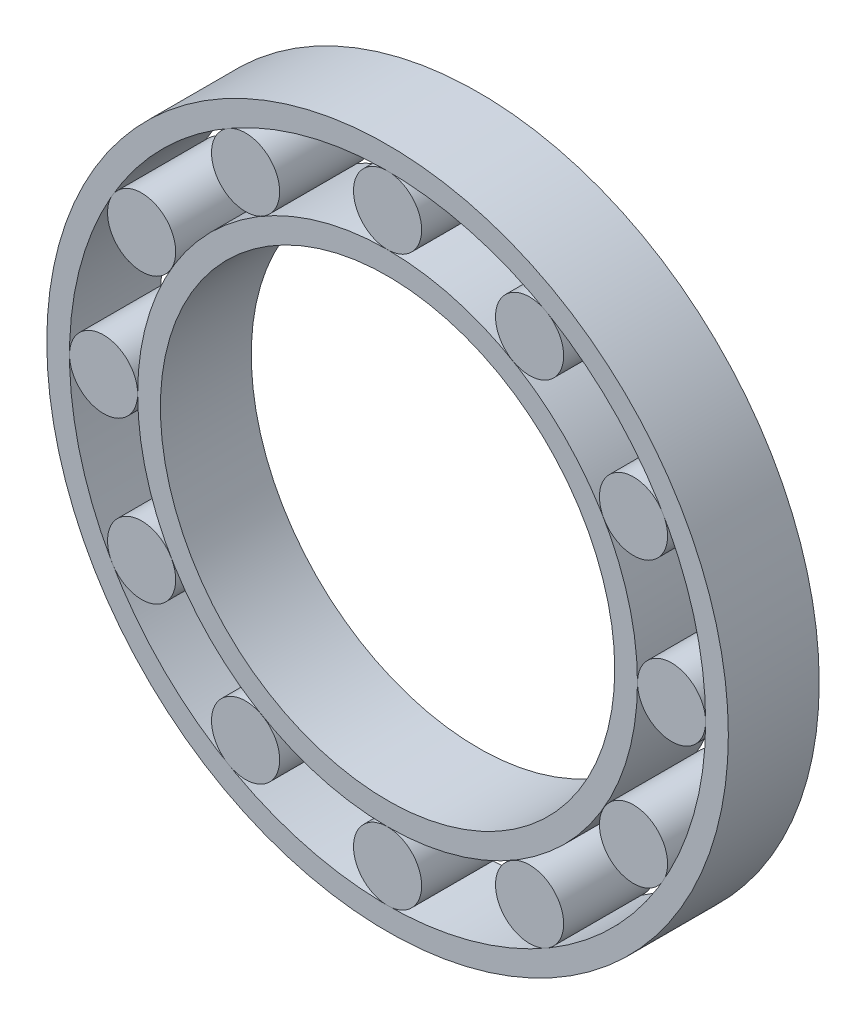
ISO-10303-21;
HEADER;
FILE_DESCRIPTION(('STEP AP214'),'2;1');
FILE_NAME('part.step','',(''),(''),'','','');
FILE_SCHEMA(('AUTOMOTIVE_DESIGN { 1 0 10303 214 1 1 1 1 }'));
ENDSEC;
DATA;
#1=APPLICATION_CONTEXT('core data for automotive mechanical design processes');
#2=APPLICATION_PROTOCOL_DEFINITION('international standard','automotive_design',2000,#1);
#3=PRODUCT_CONTEXT('',#1,'mechanical');
#4=PRODUCT('Part','Part','',(#3));
#5=PRODUCT_RELATED_PRODUCT_CATEGORY('part','',(#4));
#6=PRODUCT_DEFINITION_FORMATION('','',#4);
#7=PRODUCT_DEFINITION_CONTEXT('part definition',#1,'design');
#8=PRODUCT_DEFINITION('design','',#6,#7);
#9=PRODUCT_DEFINITION_SHAPE('','',#8);
#10=(LENGTH_UNIT() NAMED_UNIT(*) SI_UNIT(.MILLI.,.METRE.));
#11=(NAMED_UNIT(*) PLANE_ANGLE_UNIT() SI_UNIT($,.RADIAN.));
#12=(NAMED_UNIT(*) SI_UNIT($,.STERADIAN.) SOLID_ANGLE_UNIT());
#13=UNCERTAINTY_MEASURE_WITH_UNIT(LENGTH_MEASURE(1.E-05),#10,'distance_accuracy_value','');
#14=(GEOMETRIC_REPRESENTATION_CONTEXT(3) GLOBAL_UNCERTAINTY_ASSIGNED_CONTEXT((#13)) GLOBAL_UNIT_ASSIGNED_CONTEXT((#10,
#11,#12)) REPRESENTATION_CONTEXT('',''));
#15=CARTESIAN_POINT('',(0.,0.,0.));
#16=DIRECTION('',(0.,0.,1.));
#17=DIRECTION('',(1.,0.,0.));
#18=AXIS2_PLACEMENT_3D('',#15,#16,#17);
#19=CARTESIAN_POINT('',(-3.96874999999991,6.87407664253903,0.));
#20=DIRECTION('',(0.,0.,1.));
#21=DIRECTION('',(1.,0.,0.));
#22=AXIS2_PLACEMENT_3D('',#19,#20,#21);
#23=CYLINDRICAL_SURFACE('',#22,0.952499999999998);
#24=CARTESIAN_POINT('',(-3.96874999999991,6.87407664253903,0.));
#25=DIRECTION('',(0.,0.,1.));
#26=DIRECTION('',(1.,0.,0.));
#27=AXIS2_PLACEMENT_3D('',#24,#25,#26);
#28=CIRCLE('',#27,0.952499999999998);
#29=CARTESIAN_POINT('',(-3.01624999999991,6.87407664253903,0.));
#30=VERTEX_POINT('',#29);
#31=EDGE_CURVE('E12',#30,#30,#28,.T.);
#32=ORIENTED_EDGE('',*,*,#31,.T.);
#33=EDGE_LOOP('',(#32));
#34=FACE_BOUND('',#33,.T.);
#35=CARTESIAN_POINT('',(-3.96874999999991,6.87407664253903,2.54));
#36=DIRECTION('',(0.,0.,1.));
#37=DIRECTION('',(1.,0.,0.));
#38=AXIS2_PLACEMENT_3D('',#35,#36,#37);
#39=CIRCLE('',#38,0.952499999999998);
#40=CARTESIAN_POINT('',(-3.01624999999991,6.87407664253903,2.54));
#41=VERTEX_POINT('',#40);
#42=EDGE_CURVE('E51',#41,#41,#39,.T.);
#43=ORIENTED_EDGE('',*,*,#42,.F.);
#44=EDGE_LOOP('',(#43));
#45=FACE_BOUND('',#44,.T.);
#46=ADVANCED_FACE('F48',(#34,#45),#23,.T.);
#47=CARTESIAN_POINT('',(-3.96874999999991,6.87407664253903,0.));
#48=DIRECTION('',(0.,0.,1.));
#49=DIRECTION('',(1.,0.,0.));
#50=AXIS2_PLACEMENT_3D('',#47,#48,#49);
#51=PLANE('',#50);
#52=ORIENTED_EDGE('',*,*,#31,.F.);
#53=EDGE_LOOP('',(#52));
#54=FACE_BOUND('',#53,.T.);
#55=ADVANCED_FACE('F63',(#54),#51,.F.);
#56=CARTESIAN_POINT('',(-3.96874999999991,6.87407664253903,2.54));
#57=DIRECTION('',(0.,0.,1.));
#58=DIRECTION('',(1.,0.,0.));
#59=AXIS2_PLACEMENT_3D('',#56,#57,#58);
#60=PLANE('',#59);
#61=ORIENTED_EDGE('',*,*,#42,.T.);
#62=EDGE_LOOP('',(#61));
#63=FACE_BOUND('',#62,.T.);
#64=ADVANCED_FACE('F60',(#63),#60,.T.);
#65=CLOSED_SHELL('',(#46,#55,#64));
#66=MANIFOLD_SOLID_BREP('B2',#65);
#67=CARTESIAN_POINT('',(-6.87407664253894,3.96875000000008,0.));
#68=DIRECTION('',(0.,0.,1.));
#69=DIRECTION('',(1.,0.,0.));
#70=AXIS2_PLACEMENT_3D('',#67,#68,#69);
#71=CYLINDRICAL_SURFACE('',#70,0.952499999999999);
#72=CARTESIAN_POINT('',(-6.87407664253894,3.96875000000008,0.));
#73=DIRECTION('',(0.,0.,1.));
#74=DIRECTION('',(1.,0.,0.));
#75=AXIS2_PLACEMENT_3D('',#72,#73,#74);
#76=CIRCLE('',#75,0.952499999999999);
#77=CARTESIAN_POINT('',(-5.92157664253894,3.96875000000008,0.));
#78=VERTEX_POINT('',#77);
#79=EDGE_CURVE('E47',#78,#78,#76,.T.);
#80=ORIENTED_EDGE('',*,*,#79,.T.);
#81=EDGE_LOOP('',(#80));
#82=FACE_BOUND('',#81,.T.);
#83=CARTESIAN_POINT('',(-6.87407664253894,3.96875000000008,2.54));
#84=DIRECTION('',(0.,0.,1.));
#85=DIRECTION('',(1.,0.,0.));
#86=AXIS2_PLACEMENT_3D('',#83,#84,#85);
#87=CIRCLE('',#86,0.952499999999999);
#88=CARTESIAN_POINT('',(-5.92157664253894,3.96875000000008,2.54));
#89=VERTEX_POINT('',#88);
#90=EDGE_CURVE('E100',#89,#89,#87,.T.);
#91=ORIENTED_EDGE('',*,*,#90,.F.);
#92=EDGE_LOOP('',(#91));
#93=FACE_BOUND('',#92,.T.);
#94=ADVANCED_FACE('F97',(#82,#93),#71,.T.);
#95=CARTESIAN_POINT('',(-6.87407664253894,3.96875000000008,0.));
#96=DIRECTION('',(0.,0.,1.));
#97=DIRECTION('',(1.,0.,0.));
#98=AXIS2_PLACEMENT_3D('',#95,#96,#97);
#99=PLANE('',#98);
#100=ORIENTED_EDGE('',*,*,#79,.F.);
#101=EDGE_LOOP('',(#100));
#102=FACE_BOUND('',#101,.T.);
#103=ADVANCED_FACE('F112',(#102),#99,.F.);
#104=CARTESIAN_POINT('',(-6.87407664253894,3.96875000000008,2.54));
#105=DIRECTION('',(0.,0.,1.));
#106=DIRECTION('',(1.,0.,0.));
#107=AXIS2_PLACEMENT_3D('',#104,#105,#106);
#108=PLANE('',#107);
#109=ORIENTED_EDGE('',*,*,#90,.T.);
#110=EDGE_LOOP('',(#109));
#111=FACE_BOUND('',#110,.T.);
#112=ADVANCED_FACE('F109',(#111),#108,.T.);
#113=CLOSED_SHELL('',(#94,#103,#112));
#114=MANIFOLD_SOLID_BREP('B7',#113);
#115=CARTESIAN_POINT('',(-7.93749999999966,-3.37909946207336E-13,0.));
#116=DIRECTION('',(0.,0.,1.));
#117=DIRECTION('',(1.,0.,0.));
#118=AXIS2_PLACEMENT_3D('',#115,#116,#117);
#119=CYLINDRICAL_SURFACE('',#118,0.9525000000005);
#120=CARTESIAN_POINT('',(-7.93749999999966,-3.37909946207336E-13,0.));
#121=DIRECTION('',(0.,0.,1.));
#122=DIRECTION('',(1.,0.,0.));
#123=AXIS2_PLACEMENT_3D('',#120,#121,#122);
#124=CIRCLE('',#123,0.9525000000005);
#125=CARTESIAN_POINT('',(-6.98499999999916,-3.37909946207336E-13,0.));
#126=VERTEX_POINT('',#125);
#127=EDGE_CURVE('E96',#126,#126,#124,.T.);
#128=ORIENTED_EDGE('',*,*,#127,.T.);
#129=EDGE_LOOP('',(#128));
#130=FACE_BOUND('',#129,.T.);
#131=CARTESIAN_POINT('',(-7.93749999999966,-3.37909946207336E-13,2.54));
#132=DIRECTION('',(0.,0.,1.));
#133=DIRECTION('',(1.,0.,0.));
#134=AXIS2_PLACEMENT_3D('',#131,#132,#133);
#135=CIRCLE('',#134,0.9525000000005);
#136=CARTESIAN_POINT('',(-6.98499999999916,-3.37909946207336E-13,2.54));
#137=VERTEX_POINT('',#136);
#138=EDGE_CURVE('E149',#137,#137,#135,.T.);
#139=ORIENTED_EDGE('',*,*,#138,.F.);
#140=EDGE_LOOP('',(#139));
#141=FACE_BOUND('',#140,.T.);
#142=ADVANCED_FACE('F146',(#130,#141),#119,.T.);
#143=CARTESIAN_POINT('',(-7.93749999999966,-3.37909946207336E-13,0.));
#144=DIRECTION('',(0.,0.,1.));
#145=DIRECTION('',(1.,0.,0.));
#146=AXIS2_PLACEMENT_3D('',#143,#144,#145);
#147=PLANE('',#146);
#148=ORIENTED_EDGE('',*,*,#127,.F.);
#149=EDGE_LOOP('',(#148));
#150=FACE_BOUND('',#149,.T.);
#151=ADVANCED_FACE('F161',(#150),#147,.F.);
#152=CARTESIAN_POINT('',(-7.93749999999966,-3.37909946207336E-13,2.54));
#153=DIRECTION('',(0.,0.,1.));
#154=DIRECTION('',(1.,0.,0.));
#155=AXIS2_PLACEMENT_3D('',#152,#153,#154);
#156=PLANE('',#155);
#157=ORIENTED_EDGE('',*,*,#138,.T.);
#158=EDGE_LOOP('',(#157));
#159=FACE_BOUND('',#158,.T.);
#160=ADVANCED_FACE('F158',(#159),#156,.T.);
#161=CLOSED_SHELL('',(#142,#151,#160));
#162=MANIFOLD_SOLID_BREP('B42',#161);
#163=CARTESIAN_POINT('',(-6.87407664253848,-3.96875000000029,0.));
#164=DIRECTION('',(0.,0.,1.));
#165=DIRECTION('',(1.,0.,0.));
#166=AXIS2_PLACEMENT_3D('',#163,#164,#165);
#167=CYLINDRICAL_SURFACE('',#166,0.952500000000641);
#168=CARTESIAN_POINT('',(-6.87407664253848,-3.96875000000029,0.));
#169=DIRECTION('',(0.,0.,1.));
#170=DIRECTION('',(1.,0.,0.));
#171=AXIS2_PLACEMENT_3D('',#168,#169,#170);
#172=CIRCLE('',#171,0.952500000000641);
#173=CARTESIAN_POINT('',(-5.92157664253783,-3.96875000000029,0.));
#174=VERTEX_POINT('',#173);
#175=EDGE_CURVE('E145',#174,#174,#172,.T.);
#176=ORIENTED_EDGE('',*,*,#175,.T.);
#177=EDGE_LOOP('',(#176));
#178=FACE_BOUND('',#177,.T.);
#179=CARTESIAN_POINT('',(-6.87407664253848,-3.96875000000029,2.54));
#180=DIRECTION('',(0.,0.,1.));
#181=DIRECTION('',(1.,0.,0.));
#182=AXIS2_PLACEMENT_3D('',#179,#180,#181);
#183=CIRCLE('',#182,0.952500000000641);
#184=CARTESIAN_POINT('',(-5.92157664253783,-3.96875000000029,2.54));
#185=VERTEX_POINT('',#184);
#186=EDGE_CURVE('E198',#185,#185,#183,.T.);
#187=ORIENTED_EDGE('',*,*,#186,.F.);
#188=EDGE_LOOP('',(#187));
#189=FACE_BOUND('',#188,.T.);
#190=ADVANCED_FACE('F195',(#178,#189),#167,.T.);
#191=CARTESIAN_POINT('',(-6.87407664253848,-3.96875000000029,0.));
#192=DIRECTION('',(0.,0.,1.));
#193=DIRECTION('',(1.,0.,0.));
#194=AXIS2_PLACEMENT_3D('',#191,#192,#193);
#195=PLANE('',#194);
#196=ORIENTED_EDGE('',*,*,#175,.F.);
#197=EDGE_LOOP('',(#196));
#198=FACE_BOUND('',#197,.T.);
#199=ADVANCED_FACE('F210',(#198),#195,.F.);
#200=CARTESIAN_POINT('',(-6.87407664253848,-3.96875000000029,2.54));
#201=DIRECTION('',(0.,0.,1.));
#202=DIRECTION('',(1.,0.,0.));
#203=AXIS2_PLACEMENT_3D('',#200,#201,#202);
#204=PLANE('',#203);
#205=ORIENTED_EDGE('',*,*,#186,.T.);
#206=EDGE_LOOP('',(#205));
#207=FACE_BOUND('',#206,.T.);
#208=ADVANCED_FACE('F207',(#207),#204,.T.);
#209=CLOSED_SHELL('',(#190,#199,#208));
#210=MANIFOLD_SOLID_BREP('B91',#209);
#211=CARTESIAN_POINT('',(-3.96874999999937,-6.87407664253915,0.));
#212=DIRECTION('',(0.,0.,1.));
#213=DIRECTION('',(1.,0.,0.));
#214=AXIS2_PLACEMENT_3D('',#211,#212,#213);
#215=CYLINDRICAL_SURFACE('',#214,0.952500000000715);
#216=CARTESIAN_POINT('',(-3.96874999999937,-6.87407664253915,0.));
#217=DIRECTION('',(0.,0.,1.));
#218=DIRECTION('',(1.,0.,0.));
#219=AXIS2_PLACEMENT_3D('',#216,#217,#218);
#220=CIRCLE('',#219,0.952500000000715);
#221=CARTESIAN_POINT('',(-3.01624999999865,-6.87407664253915,0.));
#222=VERTEX_POINT('',#221);
#223=EDGE_CURVE('E194',#222,#222,#220,.T.);
#224=ORIENTED_EDGE('',*,*,#223,.T.);
#225=EDGE_LOOP('',(#224));
#226=FACE_BOUND('',#225,.T.);
#227=CARTESIAN_POINT('',(-3.96874999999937,-6.87407664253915,2.54));
#228=DIRECTION('',(0.,0.,1.));
#229=DIRECTION('',(1.,0.,0.));
#230=AXIS2_PLACEMENT_3D('',#227,#228,#229);
#231=CIRCLE('',#230,0.952500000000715);
#232=CARTESIAN_POINT('',(-3.01624999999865,-6.87407664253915,2.54));
#233=VERTEX_POINT('',#232);
#234=EDGE_CURVE('E247',#233,#233,#231,.T.);
#235=ORIENTED_EDGE('',*,*,#234,.F.);
#236=EDGE_LOOP('',(#235));
#237=FACE_BOUND('',#236,.T.);
#238=ADVANCED_FACE('F244',(#226,#237),#215,.T.);
#239=CARTESIAN_POINT('',(-3.96874999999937,-6.87407664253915,0.));
#240=DIRECTION('',(0.,0.,1.));
#241=DIRECTION('',(1.,0.,0.));
#242=AXIS2_PLACEMENT_3D('',#239,#240,#241);
#243=PLANE('',#242);
#244=ORIENTED_EDGE('',*,*,#223,.F.);
#245=EDGE_LOOP('',(#244));
#246=FACE_BOUND('',#245,.T.);
#247=ADVANCED_FACE('F259',(#246),#243,.F.);
#248=CARTESIAN_POINT('',(-3.96874999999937,-6.87407664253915,2.54));
#249=DIRECTION('',(0.,0.,1.));
#250=DIRECTION('',(1.,0.,0.));
#251=AXIS2_PLACEMENT_3D('',#248,#249,#250);
#252=PLANE('',#251);
#253=ORIENTED_EDGE('',*,*,#234,.T.);
#254=EDGE_LOOP('',(#253));
#255=FACE_BOUND('',#254,.T.);
#256=ADVANCED_FACE('F256',(#255),#252,.T.);
#257=CLOSED_SHELL('',(#238,#247,#256));
#258=MANIFOLD_SOLID_BREP('B140',#257);
#259=CARTESIAN_POINT('',(6.74781980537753E-13,-7.9375,0.));
#260=DIRECTION('',(0.,0.,1.));
#261=DIRECTION('',(1.,0.,0.));
#262=AXIS2_PLACEMENT_3D('',#259,#260,#261);
#263=CYLINDRICAL_SURFACE('',#262,0.952500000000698);
#264=CARTESIAN_POINT('',(6.74781980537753E-13,-7.9375,0.));
#265=DIRECTION('',(0.,0.,1.));
#266=DIRECTION('',(1.,0.,0.));
#267=AXIS2_PLACEMENT_3D('',#264,#265,#266);
#268=CIRCLE('',#267,0.952500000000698);
#269=CARTESIAN_POINT('',(0.952500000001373,-7.9375,0.));
#270=VERTEX_POINT('',#269);
#271=EDGE_CURVE('E243',#270,#270,#268,.T.);
#272=ORIENTED_EDGE('',*,*,#271,.T.);
#273=EDGE_LOOP('',(#272));
#274=FACE_BOUND('',#273,.T.);
#275=CARTESIAN_POINT('',(6.74781980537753E-13,-7.9375,2.54));
#276=DIRECTION('',(0.,0.,1.));
#277=DIRECTION('',(1.,0.,0.));
#278=AXIS2_PLACEMENT_3D('',#275,#276,#277);
#279=CIRCLE('',#278,0.952500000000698);
#280=CARTESIAN_POINT('',(0.952500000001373,-7.9375,2.54));
#281=VERTEX_POINT('',#280);
#282=EDGE_CURVE('E296',#281,#281,#279,.T.);
#283=ORIENTED_EDGE('',*,*,#282,.F.);
#284=EDGE_LOOP('',(#283));
#285=FACE_BOUND('',#284,.T.);
#286=ADVANCED_FACE('F293',(#274,#285),#263,.T.);
#287=CARTESIAN_POINT('',(6.74781980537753E-13,-7.9375,0.));
#288=DIRECTION('',(0.,0.,1.));
#289=DIRECTION('',(1.,0.,0.));
#290=AXIS2_PLACEMENT_3D('',#287,#288,#289);
#291=PLANE('',#290);
#292=ORIENTED_EDGE('',*,*,#271,.F.);
#293=EDGE_LOOP('',(#292));
#294=FACE_BOUND('',#293,.T.);
#295=ADVANCED_FACE('F308',(#294),#291,.F.);
#296=CARTESIAN_POINT('',(6.74781980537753E-13,-7.9375,2.54));
#297=DIRECTION('',(0.,0.,1.));
#298=DIRECTION('',(1.,0.,0.));
#299=AXIS2_PLACEMENT_3D('',#296,#297,#298);
#300=PLANE('',#299);
#301=ORIENTED_EDGE('',*,*,#282,.T.);
#302=EDGE_LOOP('',(#301));
#303=FACE_BOUND('',#302,.T.);
#304=ADVANCED_FACE('F305',(#303),#300,.T.);
#305=CLOSED_SHELL('',(#286,#295,#304));
#306=MANIFOLD_SOLID_BREP('B189',#305);
#307=CARTESIAN_POINT('',(3.96875000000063,-6.87407664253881,0.));
#308=DIRECTION('',(0.,0.,1.));
#309=DIRECTION('',(1.,0.,0.));
#310=AXIS2_PLACEMENT_3D('',#307,#308,#309);
#311=CYLINDRICAL_SURFACE('',#310,0.952500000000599);
#312=CARTESIAN_POINT('',(3.96875000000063,-6.87407664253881,0.));
#313=DIRECTION('',(0.,0.,1.));
#314=DIRECTION('',(1.,0.,0.));
#315=AXIS2_PLACEMENT_3D('',#312,#313,#314);
#316=CIRCLE('',#315,0.952500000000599);
#317=CARTESIAN_POINT('',(4.92125000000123,-6.87407664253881,0.));
#318=VERTEX_POINT('',#317);
#319=EDGE_CURVE('E292',#318,#318,#316,.T.);
#320=ORIENTED_EDGE('',*,*,#319,.T.);
#321=EDGE_LOOP('',(#320));
#322=FACE_BOUND('',#321,.T.);
#323=CARTESIAN_POINT('',(3.96875000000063,-6.87407664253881,2.54));
#324=DIRECTION('',(0.,0.,1.));
#325=DIRECTION('',(1.,0.,0.));
#326=AXIS2_PLACEMENT_3D('',#323,#324,#325);
#327=CIRCLE('',#326,0.952500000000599);
#328=CARTESIAN_POINT('',(4.92125000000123,-6.87407664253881,2.54));
#329=VERTEX_POINT('',#328);
#330=EDGE_CURVE('E345',#329,#329,#327,.T.);
#331=ORIENTED_EDGE('',*,*,#330,.F.);
#332=EDGE_LOOP('',(#331));
#333=FACE_BOUND('',#332,.T.);
#334=ADVANCED_FACE('F342',(#322,#333),#311,.T.);
#335=CARTESIAN_POINT('',(3.96875000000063,-6.87407664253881,0.));
#336=DIRECTION('',(0.,0.,1.));
#337=DIRECTION('',(1.,0.,0.));
#338=AXIS2_PLACEMENT_3D('',#335,#336,#337);
#339=PLANE('',#338);
#340=ORIENTED_EDGE('',*,*,#319,.F.);
#341=EDGE_LOOP('',(#340));
#342=FACE_BOUND('',#341,.T.);
#343=ADVANCED_FACE('F357',(#342),#339,.F.);
#344=CARTESIAN_POINT('',(3.96875000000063,-6.87407664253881,2.54));
#345=DIRECTION('',(0.,0.,1.));
#346=DIRECTION('',(1.,0.,0.));
#347=AXIS2_PLACEMENT_3D('',#344,#345,#346);
#348=PLANE('',#347);
#349=ORIENTED_EDGE('',*,*,#330,.T.);
#350=EDGE_LOOP('',(#349));
#351=FACE_BOUND('',#350,.T.);
#352=ADVANCED_FACE('F354',(#351),#348,.T.);
#353=CLOSED_SHELL('',(#334,#343,#352));
#354=MANIFOLD_SOLID_BREP('B238',#353);
#355=CARTESIAN_POINT('',(6.87407664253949,-3.96874999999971,0.));
#356=DIRECTION('',(0.,0.,1.));
#357=DIRECTION('',(1.,0.,0.));
#358=AXIS2_PLACEMENT_3D('',#355,#356,#357);
#359=CYLINDRICAL_SURFACE('',#358,0.952500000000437);
#360=CARTESIAN_POINT('',(6.87407664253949,-3.96874999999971,0.));
#361=DIRECTION('',(0.,0.,1.));
#362=DIRECTION('',(1.,0.,0.));
#363=AXIS2_PLACEMENT_3D('',#360,#361,#362);
#364=CIRCLE('',#363,0.952500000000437);
#365=CARTESIAN_POINT('',(7.82657664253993,-3.96874999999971,0.));
#366=VERTEX_POINT('',#365);
#367=EDGE_CURVE('E341',#366,#366,#364,.T.);
#368=ORIENTED_EDGE('',*,*,#367,.T.);
#369=EDGE_LOOP('',(#368));
#370=FACE_BOUND('',#369,.T.);
#371=CARTESIAN_POINT('',(6.87407664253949,-3.96874999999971,2.54));
#372=DIRECTION('',(0.,0.,1.));
#373=DIRECTION('',(1.,0.,0.));
#374=AXIS2_PLACEMENT_3D('',#371,#372,#373);
#375=CIRCLE('',#374,0.952500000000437);
#376=CARTESIAN_POINT('',(7.82657664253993,-3.96874999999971,2.54));
#377=VERTEX_POINT('',#376);
#378=EDGE_CURVE('E394',#377,#377,#375,.T.);
#379=ORIENTED_EDGE('',*,*,#378,.F.);
#380=EDGE_LOOP('',(#379));
#381=FACE_BOUND('',#380,.T.);
#382=ADVANCED_FACE('F391',(#370,#381),#359,.T.);
#383=CARTESIAN_POINT('',(6.87407664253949,-3.96874999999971,0.));
#384=DIRECTION('',(0.,0.,1.));
#385=DIRECTION('',(1.,0.,0.));
#386=AXIS2_PLACEMENT_3D('',#383,#384,#385);
#387=PLANE('',#386);
#388=ORIENTED_EDGE('',*,*,#367,.F.);
#389=EDGE_LOOP('',(#388));
#390=FACE_BOUND('',#389,.T.);
#391=ADVANCED_FACE('F406',(#390),#387,.F.);
#392=CARTESIAN_POINT('',(6.87407664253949,-3.96874999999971,2.54));
#393=DIRECTION('',(0.,0.,1.));
#394=DIRECTION('',(1.,0.,0.));
#395=AXIS2_PLACEMENT_3D('',#392,#393,#394);
#396=PLANE('',#395);
#397=ORIENTED_EDGE('',*,*,#378,.T.);
#398=EDGE_LOOP('',(#397));
#399=FACE_BOUND('',#398,.T.);
#400=ADVANCED_FACE('F403',(#399),#396,.T.);
#401=CLOSED_SHELL('',(#382,#391,#400));
#402=MANIFOLD_SOLID_BREP('B287',#401);
#403=CARTESIAN_POINT('',(7.93750000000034,3.36937882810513E-13,0.));
#404=DIRECTION('',(0.,0.,1.));
#405=DIRECTION('',(1.,0.,0.));
#406=AXIS2_PLACEMENT_3D('',#403,#404,#405);
#407=CYLINDRICAL_SURFACE('',#406,0.952500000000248);
#408=CARTESIAN_POINT('',(7.93750000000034,3.36937882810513E-13,0.));
#409=DIRECTION('',(0.,0.,1.));
#410=DIRECTION('',(1.,0.,0.));
#411=AXIS2_PLACEMENT_3D('',#408,#409,#410);
#412=CIRCLE('',#411,0.952500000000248);
#413=CARTESIAN_POINT('',(8.89000000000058,3.36937882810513E-13,0.));
#414=VERTEX_POINT('',#413);
#415=EDGE_CURVE('E390',#414,#414,#412,.T.);
#416=ORIENTED_EDGE('',*,*,#415,.T.);
#417=EDGE_LOOP('',(#416));
#418=FACE_BOUND('',#417,.T.);
#419=CARTESIAN_POINT('',(7.93750000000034,3.36937882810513E-13,2.54));
#420=DIRECTION('',(0.,0.,1.));
#421=DIRECTION('',(1.,0.,0.));
#422=AXIS2_PLACEMENT_3D('',#419,#420,#421);
#423=CIRCLE('',#422,0.952500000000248);
#424=CARTESIAN_POINT('',(8.89000000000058,3.36937882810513E-13,2.54));
#425=VERTEX_POINT('',#424);
#426=EDGE_CURVE('E443',#425,#425,#423,.T.);
#427=ORIENTED_EDGE('',*,*,#426,.F.);
#428=EDGE_LOOP('',(#427));
#429=FACE_BOUND('',#428,.T.);
#430=ADVANCED_FACE('F440',(#418,#429),#407,.T.);
#431=CARTESIAN_POINT('',(7.93750000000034,3.36937882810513E-13,0.));
#432=DIRECTION('',(0.,0.,1.));
#433=DIRECTION('',(1.,0.,0.));
#434=AXIS2_PLACEMENT_3D('',#431,#432,#433);
#435=PLANE('',#434);
#436=ORIENTED_EDGE('',*,*,#415,.F.);
#437=EDGE_LOOP('',(#436));
#438=FACE_BOUND('',#437,.T.);
#439=ADVANCED_FACE('F455',(#438),#435,.F.);
#440=CARTESIAN_POINT('',(7.93750000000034,3.36937882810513E-13,2.54));
#441=DIRECTION('',(0.,0.,1.));
#442=DIRECTION('',(1.,0.,0.));
#443=AXIS2_PLACEMENT_3D('',#440,#441,#442);
#444=PLANE('',#443);
#445=ORIENTED_EDGE('',*,*,#426,.T.);
#446=EDGE_LOOP('',(#445));
#447=FACE_BOUND('',#446,.T.);
#448=ADVANCED_FACE('F452',(#447),#444,.T.);
#449=CLOSED_SHELL('',(#430,#439,#448));
#450=MANIFOLD_SOLID_BREP('B336',#449);
#451=CARTESIAN_POINT('',(6.87407664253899,3.96874999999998,0.));
#452=DIRECTION('',(0.,0.,1.));
#453=DIRECTION('',(1.,0.,0.));
#454=AXIS2_PLACEMENT_3D('',#451,#452,#453);
#455=CYLINDRICAL_SURFACE('',#454,0.9525);
#456=CARTESIAN_POINT('',(6.87407664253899,3.96874999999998,0.));
#457=DIRECTION('',(0.,0.,1.));
#458=DIRECTION('',(1.,0.,0.));
#459=AXIS2_PLACEMENT_3D('',#456,#457,#458);
#460=CIRCLE('',#459,0.9525);
#461=CARTESIAN_POINT('',(7.82657664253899,3.96874999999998,0.));
#462=VERTEX_POINT('',#461);
#463=EDGE_CURVE('E439',#462,#462,#460,.T.);
#464=ORIENTED_EDGE('',*,*,#463,.T.);
#465=EDGE_LOOP('',(#464));
#466=FACE_BOUND('',#465,.T.);
#467=CARTESIAN_POINT('',(6.87407664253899,3.96874999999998,2.54));
#468=DIRECTION('',(0.,0.,1.));
#469=DIRECTION('',(1.,0.,0.));
#470=AXIS2_PLACEMENT_3D('',#467,#468,#469);
#471=CIRCLE('',#470,0.9525);
#472=CARTESIAN_POINT('',(7.82657664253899,3.96874999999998,2.54));
#473=VERTEX_POINT('',#472);
#474=EDGE_CURVE('E492',#473,#473,#471,.T.);
#475=ORIENTED_EDGE('',*,*,#474,.F.);
#476=EDGE_LOOP('',(#475));
#477=FACE_BOUND('',#476,.T.);
#478=ADVANCED_FACE('F489',(#466,#477),#455,.T.);
#479=CARTESIAN_POINT('',(6.87407664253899,3.96874999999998,0.));
#480=DIRECTION('',(0.,0.,1.));
#481=DIRECTION('',(1.,0.,0.));
#482=AXIS2_PLACEMENT_3D('',#479,#480,#481);
#483=PLANE('',#482);
#484=ORIENTED_EDGE('',*,*,#463,.F.);
#485=EDGE_LOOP('',(#484));
#486=FACE_BOUND('',#485,.T.);
#487=ADVANCED_FACE('F504',(#486),#483,.F.);
#488=CARTESIAN_POINT('',(6.87407664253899,3.96874999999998,2.54));
#489=DIRECTION('',(0.,0.,1.));
#490=DIRECTION('',(1.,0.,0.));
#491=AXIS2_PLACEMENT_3D('',#488,#489,#490);
#492=PLANE('',#491);
#493=ORIENTED_EDGE('',*,*,#474,.T.);
#494=EDGE_LOOP('',(#493));
#495=FACE_BOUND('',#494,.T.);
#496=ADVANCED_FACE('F501',(#495),#492,.T.);
#497=CLOSED_SHELL('',(#478,#487,#496));
#498=MANIFOLD_SOLID_BREP('B385',#497);
#499=CARTESIAN_POINT('',(3.96875000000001,6.87407664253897,0.));
#500=DIRECTION('',(0.,0.,1.));
#501=DIRECTION('',(1.,0.,0.));
#502=AXIS2_PLACEMENT_3D('',#499,#500,#501);
#503=CYLINDRICAL_SURFACE('',#502,0.952499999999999);
#504=CARTESIAN_POINT('',(3.96875000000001,6.87407664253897,0.));
#505=DIRECTION('',(0.,0.,1.));
#506=DIRECTION('',(1.,0.,0.));
#507=AXIS2_PLACEMENT_3D('',#504,#505,#506);
#508=CIRCLE('',#507,0.952499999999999);
#509=CARTESIAN_POINT('',(4.92125000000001,6.87407664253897,0.));
#510=VERTEX_POINT('',#509);
#511=EDGE_CURVE('E488',#510,#510,#508,.T.);
#512=ORIENTED_EDGE('',*,*,#511,.T.);
#513=EDGE_LOOP('',(#512));
#514=FACE_BOUND('',#513,.T.);
#515=CARTESIAN_POINT('',(3.96875000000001,6.87407664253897,2.54));
#516=DIRECTION('',(0.,0.,1.));
#517=DIRECTION('',(1.,0.,0.));
#518=AXIS2_PLACEMENT_3D('',#515,#516,#517);
#519=CIRCLE('',#518,0.952499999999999);
#520=CARTESIAN_POINT('',(4.92125000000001,6.87407664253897,2.54));
#521=VERTEX_POINT('',#520);
#522=EDGE_CURVE('E541',#521,#521,#519,.T.);
#523=ORIENTED_EDGE('',*,*,#522,.F.);
#524=EDGE_LOOP('',(#523));
#525=FACE_BOUND('',#524,.T.);
#526=ADVANCED_FACE('F538',(#514,#525),#503,.T.);
#527=CARTESIAN_POINT('',(3.96875000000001,6.87407664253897,0.));
#528=DIRECTION('',(0.,0.,1.));
#529=DIRECTION('',(1.,0.,0.));
#530=AXIS2_PLACEMENT_3D('',#527,#528,#529);
#531=PLANE('',#530);
#532=ORIENTED_EDGE('',*,*,#511,.F.);
#533=EDGE_LOOP('',(#532));
#534=FACE_BOUND('',#533,.T.);
#535=ADVANCED_FACE('F553',(#534),#531,.F.);
#536=CARTESIAN_POINT('',(3.96875000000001,6.87407664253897,2.54));
#537=DIRECTION('',(0.,0.,1.));
#538=DIRECTION('',(1.,0.,0.));
#539=AXIS2_PLACEMENT_3D('',#536,#537,#538);
#540=PLANE('',#539);
#541=ORIENTED_EDGE('',*,*,#522,.T.);
#542=EDGE_LOOP('',(#541));
#543=FACE_BOUND('',#542,.T.);
#544=ADVANCED_FACE('F550',(#543),#540,.T.);
#545=CLOSED_SHELL('',(#526,#535,#544));
#546=MANIFOLD_SOLID_BREP('B434',#545);
#547=CARTESIAN_POINT('',(0.,7.9375,0.));
#548=DIRECTION('',(0.,0.,1.));
#549=DIRECTION('',(1.,0.,0.));
#550=AXIS2_PLACEMENT_3D('',#547,#548,#549);
#551=CYLINDRICAL_SURFACE('',#550,0.952499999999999);
#552=CARTESIAN_POINT('',(0.,7.9375,0.));
#553=DIRECTION('',(0.,0.,1.));
#554=DIRECTION('',(1.,0.,0.));
#555=AXIS2_PLACEMENT_3D('',#552,#553,#554);
#556=CIRCLE('',#555,0.952499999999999);
#557=CARTESIAN_POINT('',(0.9525,7.9375,0.));
#558=VERTEX_POINT('',#557);
#559=EDGE_CURVE('E537',#558,#558,#556,.T.);
#560=ORIENTED_EDGE('',*,*,#559,.T.);
#561=EDGE_LOOP('',(#560));
#562=FACE_BOUND('',#561,.T.);
#563=CARTESIAN_POINT('',(0.,7.9375,2.54));
#564=DIRECTION('',(0.,0.,1.));
#565=DIRECTION('',(1.,0.,0.));
#566=AXIS2_PLACEMENT_3D('',#563,#564,#565);
#567=CIRCLE('',#566,0.952499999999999);
#568=CARTESIAN_POINT('',(0.9525,7.9375,2.54));
#569=VERTEX_POINT('',#568);
#570=EDGE_CURVE('E590',#569,#569,#567,.T.);
#571=ORIENTED_EDGE('',*,*,#570,.F.);
#572=EDGE_LOOP('',(#571));
#573=FACE_BOUND('',#572,.T.);
#574=ADVANCED_FACE('F587',(#562,#573),#551,.T.);
#575=CARTESIAN_POINT('',(0.,7.9375,0.));
#576=DIRECTION('',(0.,0.,1.));
#577=DIRECTION('',(1.,0.,0.));
#578=AXIS2_PLACEMENT_3D('',#575,#576,#577);
#579=PLANE('',#578);
#580=ORIENTED_EDGE('',*,*,#559,.F.);
#581=EDGE_LOOP('',(#580));
#582=FACE_BOUND('',#581,.T.);
#583=ADVANCED_FACE('F602',(#582),#579,.F.);
#584=CARTESIAN_POINT('',(0.,7.9375,2.54));
#585=DIRECTION('',(0.,0.,1.));
#586=DIRECTION('',(1.,0.,0.));
#587=AXIS2_PLACEMENT_3D('',#584,#585,#586);
#588=PLANE('',#587);
#589=ORIENTED_EDGE('',*,*,#570,.T.);
#590=EDGE_LOOP('',(#589));
#591=FACE_BOUND('',#590,.T.);
#592=ADVANCED_FACE('F599',(#591),#588,.T.);
#593=CLOSED_SHELL('',(#574,#583,#592));
#594=MANIFOLD_SOLID_BREP('B483',#593);
#595=CARTESIAN_POINT('',(0.,0.,2.54));
#596=DIRECTION('',(0.,0.,-1.));
#597=DIRECTION('',(-1.,0.,0.));
#598=AXIS2_PLACEMENT_3D('',#595,#596,#597);
#599=CYLINDRICAL_SURFACE('',#598,6.35);
#600=CARTESIAN_POINT('',(0.,0.,2.54));
#601=DIRECTION('',(0.,0.,1.));
#602=DIRECTION('',(1.,0.,0.));
#603=AXIS2_PLACEMENT_3D('',#600,#601,#602);
#604=CIRCLE('',#603,6.35);
#605=CARTESIAN_POINT('',(6.35,0.,2.54));
#606=VERTEX_POINT('',#605);
#607=EDGE_CURVE('E642',#606,#606,#604,.T.);
#608=ORIENTED_EDGE('',*,*,#607,.T.);
#609=EDGE_LOOP('',(#608));
#610=FACE_BOUND('',#609,.T.);
#611=CARTESIAN_POINT('',(0.,0.,0.));
#612=DIRECTION('',(0.,0.,1.));
#613=DIRECTION('',(1.,0.,0.));
#614=AXIS2_PLACEMENT_3D('',#611,#612,#613);
#615=CIRCLE('',#614,6.35);
#616=CARTESIAN_POINT('',(6.35,0.,0.));
#617=VERTEX_POINT('',#616);
#618=EDGE_CURVE('E648',#617,#617,#615,.T.);
#619=ORIENTED_EDGE('',*,*,#618,.F.);
#620=EDGE_LOOP('',(#619));
#621=FACE_BOUND('',#620,.T.);
#622=ADVANCED_FACE('F635',(#610,#621),#599,.F.);
#623=CARTESIAN_POINT('',(0.,0.,2.54));
#624=DIRECTION('',(0.,0.,-1.));
#625=DIRECTION('',(-1.,0.,0.));
#626=AXIS2_PLACEMENT_3D('',#623,#624,#625);
#627=CYLINDRICAL_SURFACE('',#626,6.985);
#628=CARTESIAN_POINT('',(0.,0.,2.54));
#629=DIRECTION('',(0.,0.,1.));
#630=DIRECTION('',(1.,0.,0.));
#631=AXIS2_PLACEMENT_3D('',#628,#629,#630);
#632=CIRCLE('',#631,6.985);
#633=CARTESIAN_POINT('',(6.985,0.,2.54));
#634=VERTEX_POINT('',#633);
#635=EDGE_CURVE('E586',#634,#634,#632,.T.);
#636=ORIENTED_EDGE('',*,*,#635,.F.);
#637=EDGE_LOOP('',(#636));
#638=FACE_BOUND('',#637,.T.);
#639=CARTESIAN_POINT('',(0.,0.,0.));
#640=DIRECTION('',(0.,0.,1.));
#641=DIRECTION('',(1.,0.,0.));
#642=AXIS2_PLACEMENT_3D('',#639,#640,#641);
#643=CIRCLE('',#642,6.985);
#644=CARTESIAN_POINT('',(6.985,0.,0.));
#645=VERTEX_POINT('',#644);
#646=EDGE_CURVE('E638',#645,#645,#643,.T.);
#647=ORIENTED_EDGE('',*,*,#646,.T.);
#648=EDGE_LOOP('',(#647));
#649=FACE_BOUND('',#648,.T.);
#650=ADVANCED_FACE('F655',(#638,#649),#627,.T.);
#651=CARTESIAN_POINT('',(0.,0.,2.54));
#652=DIRECTION('',(0.,0.,1.));
#653=DIRECTION('',(1.,0.,0.));
#654=AXIS2_PLACEMENT_3D('',#651,#652,#653);
#655=PLANE('',#654);
#656=ORIENTED_EDGE('',*,*,#607,.F.);
#657=EDGE_LOOP('',(#656));
#658=FACE_BOUND('',#657,.T.);
#659=ORIENTED_EDGE('',*,*,#635,.T.);
#660=EDGE_LOOP('',(#659));
#661=FACE_BOUND('',#660,.T.);
#662=ADVANCED_FACE('F659',(#658,#661),#655,.T.);
#663=CARTESIAN_POINT('',(0.,0.,0.));
#664=DIRECTION('',(0.,0.,1.));
#665=DIRECTION('',(1.,0.,0.));
#666=AXIS2_PLACEMENT_3D('',#663,#664,#665);
#667=PLANE('',#666);
#668=ORIENTED_EDGE('',*,*,#618,.T.);
#669=EDGE_LOOP('',(#668));
#670=FACE_BOUND('',#669,.T.);
#671=ORIENTED_EDGE('',*,*,#646,.F.);
#672=EDGE_LOOP('',(#671));
#673=FACE_BOUND('',#672,.T.);
#674=ADVANCED_FACE('F657',(#670,#673),#667,.F.);
#675=CLOSED_SHELL('',(#622,#650,#662,#674));
#676=MANIFOLD_SOLID_BREP('B532',#675);
#677=CARTESIAN_POINT('',(0.,0.,2.54));
#678=DIRECTION('',(0.,0.,-1.));
#679=DIRECTION('',(-1.,0.,0.));
#680=AXIS2_PLACEMENT_3D('',#677,#678,#679);
#681=CYLINDRICAL_SURFACE('',#680,8.89);
#682=CARTESIAN_POINT('',(0.,0.,2.54));
#683=DIRECTION('',(0.,0.,1.));
#684=DIRECTION('',(1.,0.,0.));
#685=AXIS2_PLACEMENT_3D('',#682,#683,#684);
#686=CIRCLE('',#685,8.89);
#687=CARTESIAN_POINT('',(8.89,0.,2.54));
#688=VERTEX_POINT('',#687);
#689=EDGE_CURVE('E698',#688,#688,#686,.T.);
#690=ORIENTED_EDGE('',*,*,#689,.T.);
#691=EDGE_LOOP('',(#690));
#692=FACE_BOUND('',#691,.T.);
#693=CARTESIAN_POINT('',(0.,0.,0.));
#694=DIRECTION('',(0.,0.,1.));
#695=DIRECTION('',(1.,0.,0.));
#696=AXIS2_PLACEMENT_3D('',#693,#694,#695);
#697=CIRCLE('',#696,8.89);
#698=CARTESIAN_POINT('',(8.89,0.,0.));
#699=VERTEX_POINT('',#698);
#700=EDGE_CURVE('E704',#699,#699,#697,.T.);
#701=ORIENTED_EDGE('',*,*,#700,.F.);
#702=EDGE_LOOP('',(#701));
#703=FACE_BOUND('',#702,.T.);
#704=ADVANCED_FACE('F691',(#692,#703),#681,.F.);
#705=CARTESIAN_POINT('',(0.,0.,2.54));
#706=DIRECTION('',(0.,0.,-1.));
#707=DIRECTION('',(-1.,0.,0.));
#708=AXIS2_PLACEMENT_3D('',#705,#706,#707);
#709=CYLINDRICAL_SURFACE('',#708,9.525);
#710=CARTESIAN_POINT('',(0.,0.,2.54));
#711=DIRECTION('',(0.,0.,1.));
#712=DIRECTION('',(1.,0.,0.));
#713=AXIS2_PLACEMENT_3D('',#710,#711,#712);
#714=CIRCLE('',#713,9.525);
#715=CARTESIAN_POINT('',(9.525,0.,2.54));
#716=VERTEX_POINT('',#715);
#717=EDGE_CURVE('E634',#716,#716,#714,.T.);
#718=ORIENTED_EDGE('',*,*,#717,.F.);
#719=EDGE_LOOP('',(#718));
#720=FACE_BOUND('',#719,.T.);
#721=CARTESIAN_POINT('',(0.,0.,0.));
#722=DIRECTION('',(0.,0.,1.));
#723=DIRECTION('',(1.,0.,0.));
#724=AXIS2_PLACEMENT_3D('',#721,#722,#723);
#725=CIRCLE('',#724,9.525);
#726=CARTESIAN_POINT('',(9.525,0.,0.));
#727=VERTEX_POINT('',#726);
#728=EDGE_CURVE('E694',#727,#727,#725,.T.);
#729=ORIENTED_EDGE('',*,*,#728,.T.);
#730=EDGE_LOOP('',(#729));
#731=FACE_BOUND('',#730,.T.);
#732=ADVANCED_FACE('F711',(#720,#731),#709,.T.);
#733=CARTESIAN_POINT('',(0.,0.,2.54));
#734=DIRECTION('',(0.,0.,1.));
#735=DIRECTION('',(1.,0.,0.));
#736=AXIS2_PLACEMENT_3D('',#733,#734,#735);
#737=PLANE('',#736);
#738=ORIENTED_EDGE('',*,*,#689,.F.);
#739=EDGE_LOOP('',(#738));
#740=FACE_BOUND('',#739,.T.);
#741=ORIENTED_EDGE('',*,*,#717,.T.);
#742=EDGE_LOOP('',(#741));
#743=FACE_BOUND('',#742,.T.);
#744=ADVANCED_FACE('F715',(#740,#743),#737,.T.);
#745=CARTESIAN_POINT('',(0.,0.,0.));
#746=DIRECTION('',(0.,0.,1.));
#747=DIRECTION('',(1.,0.,0.));
#748=AXIS2_PLACEMENT_3D('',#745,#746,#747);
#749=PLANE('',#748);
#750=ORIENTED_EDGE('',*,*,#700,.T.);
#751=EDGE_LOOP('',(#750));
#752=FACE_BOUND('',#751,.T.);
#753=ORIENTED_EDGE('',*,*,#728,.F.);
#754=EDGE_LOOP('',(#753));
#755=FACE_BOUND('',#754,.T.);
#756=ADVANCED_FACE('F713',(#752,#755),#749,.F.);
#757=CLOSED_SHELL('',(#704,#732,#744,#756));
#758=MANIFOLD_SOLID_BREP('B581',#757);
#759=ADVANCED_BREP_SHAPE_REPRESENTATION('',(#18,#66,#114,#162,#210,#258,#306,#354,#402,#450,
#498,#546,#594,#676,#758),#14);
#760=SHAPE_DEFINITION_REPRESENTATION(#9,#759);
ENDSEC;
END-ISO-10303-21;
